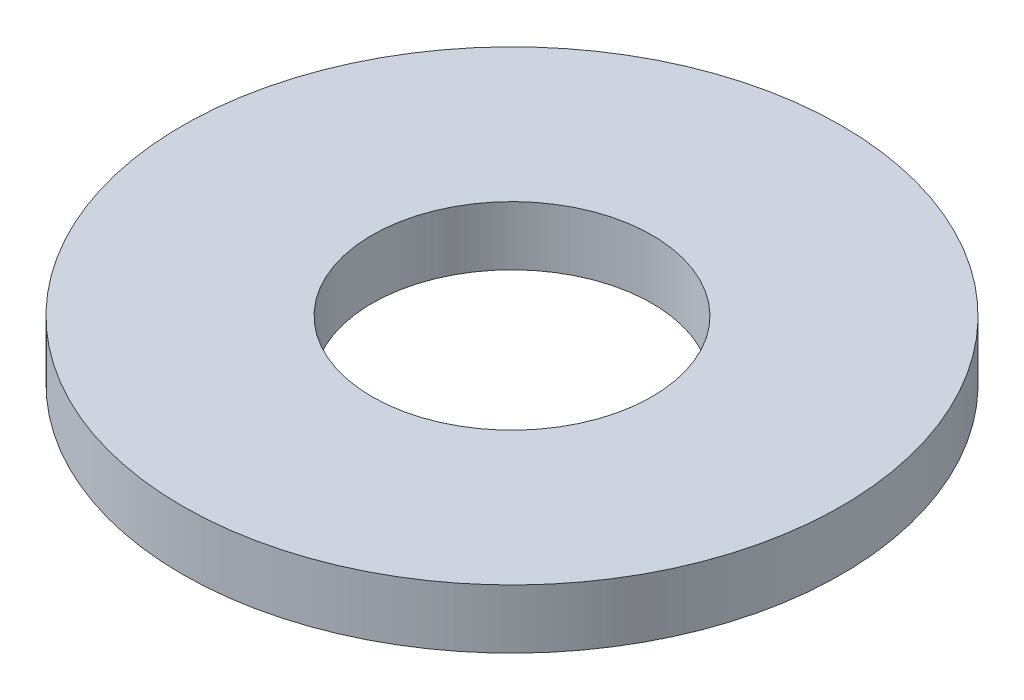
ISO-10303-21;
HEADER;
FILE_DESCRIPTION(('STEP AP214'),'2;1');
FILE_NAME('part.step','',(''),(''),'','','');
FILE_SCHEMA(('AUTOMOTIVE_DESIGN { 1 0 10303 214 1 1 1 1 }'));
ENDSEC;
DATA;
#1=APPLICATION_CONTEXT('core data for automotive mechanical design processes');
#2=APPLICATION_PROTOCOL_DEFINITION('international standard','automotive_design',2000,#1);
#3=PRODUCT_CONTEXT('',#1,'mechanical');
#4=PRODUCT('Part','Part','',(#3));
#5=PRODUCT_RELATED_PRODUCT_CATEGORY('part','',(#4));
#6=PRODUCT_DEFINITION_FORMATION('','',#4);
#7=PRODUCT_DEFINITION_CONTEXT('part definition',#1,'design');
#8=PRODUCT_DEFINITION('design','',#6,#7);
#9=PRODUCT_DEFINITION_SHAPE('','',#8);
#10=(LENGTH_UNIT() NAMED_UNIT(*) SI_UNIT(.MILLI.,.METRE.));
#11=(NAMED_UNIT(*) PLANE_ANGLE_UNIT() SI_UNIT($,.RADIAN.));
#12=(NAMED_UNIT(*) SI_UNIT($,.STERADIAN.) SOLID_ANGLE_UNIT());
#13=UNCERTAINTY_MEASURE_WITH_UNIT(LENGTH_MEASURE(1.E-05),#10,'distance_accuracy_value','');
#14=(GEOMETRIC_REPRESENTATION_CONTEXT(3) GLOBAL_UNCERTAINTY_ASSIGNED_CONTEXT((#13)) GLOBAL_UNIT_ASSIGNED_CONTEXT((#10,
#11,#12)) REPRESENTATION_CONTEXT('',''));
#15=CARTESIAN_POINT('',(0.,0.,0.));
#16=DIRECTION('',(0.,0.,1.));
#17=DIRECTION('',(1.,0.,0.));
#18=AXIS2_PLACEMENT_3D('',#15,#16,#17);
#19=CARTESIAN_POINT('',(0.,2.8448,0.));
#20=DIRECTION('',(0.,1.,0.));
#21=DIRECTION('',(0.,0.,1.));
#22=AXIS2_PLACEMENT_3D('',#19,#20,#21);
#23=PLANE('',#22);
#24=CARTESIAN_POINT('',(0.,2.8448,0.));
#25=DIRECTION('',(0.,1.,0.));
#26=DIRECTION('',(0.,0.,1.));
#27=AXIS2_PLACEMENT_3D('',#24,#25,#26);
#28=CIRCLE('',#27,15.875);
#29=CARTESIAN_POINT('',(0.,2.8448,15.875));
#30=VERTEX_POINT('',#29);
#31=EDGE_CURVE('E10',#30,#30,#28,.T.);
#32=ORIENTED_EDGE('',*,*,#31,.T.);
#33=EDGE_LOOP('',(#32));
#34=FACE_BOUND('',#33,.T.);
#35=CARTESIAN_POINT('',(0.,2.8448,0.));
#36=DIRECTION('',(0.,1.,0.));
#37=DIRECTION('',(0.,0.,1.));
#38=AXIS2_PLACEMENT_3D('',#35,#36,#37);
#39=CIRCLE('',#38,6.7437);
#40=CARTESIAN_POINT('',(0.,2.8448,6.7437));
#41=VERTEX_POINT('',#40);
#42=EDGE_CURVE('E39',#41,#41,#39,.T.);
#43=ORIENTED_EDGE('',*,*,#42,.F.);
#44=EDGE_LOOP('',(#43));
#45=FACE_BOUND('',#44,.T.);
#46=ADVANCED_FACE('F28',(#34,#45),#23,.T.);
#47=CARTESIAN_POINT('',(0.,0.,0.));
#48=DIRECTION('',(0.,1.,0.));
#49=DIRECTION('',(0.,0.,1.));
#50=AXIS2_PLACEMENT_3D('',#47,#48,#49);
#51=PLANE('',#50);
#52=CARTESIAN_POINT('',(0.,0.,0.));
#53=DIRECTION('',(0.,1.,0.));
#54=DIRECTION('',(0.,0.,1.));
#55=AXIS2_PLACEMENT_3D('',#52,#53,#54);
#56=CIRCLE('',#55,15.875);
#57=CARTESIAN_POINT('',(0.,0.,15.875));
#58=VERTEX_POINT('',#57);
#59=EDGE_CURVE('E35',#58,#58,#56,.T.);
#60=ORIENTED_EDGE('',*,*,#59,.F.);
#61=EDGE_LOOP('',(#60));
#62=FACE_BOUND('',#61,.T.);
#63=CARTESIAN_POINT('',(0.,0.,0.));
#64=DIRECTION('',(0.,1.,0.));
#65=DIRECTION('',(0.,0.,1.));
#66=AXIS2_PLACEMENT_3D('',#63,#64,#65);
#67=CIRCLE('',#66,6.7437);
#68=CARTESIAN_POINT('',(0.,0.,6.7437));
#69=VERTEX_POINT('',#68);
#70=EDGE_CURVE('E43',#69,#69,#67,.T.);
#71=ORIENTED_EDGE('',*,*,#70,.T.);
#72=EDGE_LOOP('',(#71));
#73=FACE_BOUND('',#72,.T.);
#74=ADVANCED_FACE('F49',(#62,#73),#51,.F.);
#75=CARTESIAN_POINT('',(0.,2.8448,0.));
#76=DIRECTION('',(0.,-1.,0.));
#77=DIRECTION('',(0.,0.,-1.));
#78=AXIS2_PLACEMENT_3D('',#75,#76,#77);
#79=CYLINDRICAL_SURFACE('',#78,15.875);
#80=ORIENTED_EDGE('',*,*,#31,.F.);
#81=EDGE_LOOP('',(#80));
#82=FACE_BOUND('',#81,.T.);
#83=ORIENTED_EDGE('',*,*,#59,.T.);
#84=EDGE_LOOP('',(#83));
#85=FACE_BOUND('',#84,.T.);
#86=ADVANCED_FACE('F30',(#82,#85),#79,.T.);
#87=CARTESIAN_POINT('',(0.,2.8448,0.));
#88=DIRECTION('',(0.,-1.,0.));
#89=DIRECTION('',(0.,0.,-1.));
#90=AXIS2_PLACEMENT_3D('',#87,#88,#89);
#91=CYLINDRICAL_SURFACE('',#90,6.7437);
#92=ORIENTED_EDGE('',*,*,#42,.T.);
#93=EDGE_LOOP('',(#92));
#94=FACE_BOUND('',#93,.T.);
#95=ORIENTED_EDGE('',*,*,#70,.F.);
#96=EDGE_LOOP('',(#95));
#97=FACE_BOUND('',#96,.T.);
#98=ADVANCED_FACE('F51',(#94,#97),#91,.F.);
#99=CLOSED_SHELL('',(#46,#74,#86,#98));
#100=MANIFOLD_SOLID_BREP('B2',#99);
#101=ADVANCED_BREP_SHAPE_REPRESENTATION('',(#18,#100),#14);
#102=SHAPE_DEFINITION_REPRESENTATION(#9,#101);
ENDSEC;
END-ISO-10303-21;
